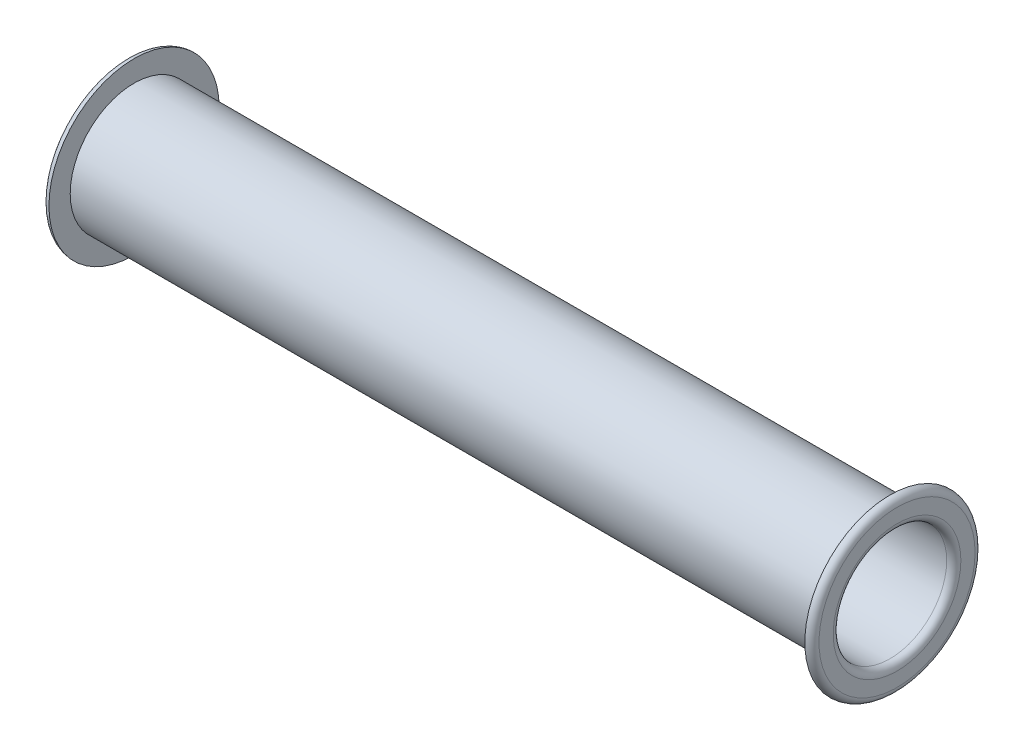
ISO-10303-21;
HEADER;
FILE_DESCRIPTION(('STEP AP214'),'2;1');
FILE_NAME('part.step','',(''),(''),'','','');
FILE_SCHEMA(('AUTOMOTIVE_DESIGN { 1 0 10303 214 1 1 1 1 }'));
ENDSEC;
DATA;
#1=APPLICATION_CONTEXT('core data for automotive mechanical design processes');
#2=APPLICATION_PROTOCOL_DEFINITION('international standard','automotive_design',2000,#1);
#3=PRODUCT_CONTEXT('',#1,'mechanical');
#4=PRODUCT('Part','Part','',(#3));
#5=PRODUCT_RELATED_PRODUCT_CATEGORY('part','',(#4));
#6=PRODUCT_DEFINITION_FORMATION('','',#4);
#7=PRODUCT_DEFINITION_CONTEXT('part definition',#1,'design');
#8=PRODUCT_DEFINITION('design','',#6,#7);
#9=PRODUCT_DEFINITION_SHAPE('','',#8);
#10=(LENGTH_UNIT() NAMED_UNIT(*) SI_UNIT(.MILLI.,.METRE.));
#11=(NAMED_UNIT(*) PLANE_ANGLE_UNIT() SI_UNIT($,.RADIAN.));
#12=(NAMED_UNIT(*) SI_UNIT($,.STERADIAN.) SOLID_ANGLE_UNIT());
#13=UNCERTAINTY_MEASURE_WITH_UNIT(LENGTH_MEASURE(1.E-05),#10,'distance_accuracy_value','');
#14=(GEOMETRIC_REPRESENTATION_CONTEXT(3) GLOBAL_UNCERTAINTY_ASSIGNED_CONTEXT((#13)) GLOBAL_UNIT_ASSIGNED_CONTEXT((#10,
#11,#12)) REPRESENTATION_CONTEXT('',''));
#15=CARTESIAN_POINT('',(0.,0.,0.));
#16=DIRECTION('',(0.,0.,1.));
#17=DIRECTION('',(1.,0.,0.));
#18=AXIS2_PLACEMENT_3D('',#15,#16,#17);
#19=CARTESIAN_POINT('',(13.53185,0.,0.));
#20=DIRECTION('',(-1.,0.,0.));
#21=DIRECTION('',(0.,0.,1.));
#22=AXIS2_PLACEMENT_3D('',#19,#20,#21);
#23=CYLINDRICAL_SURFACE('',#22,2.286);
#24=CARTESIAN_POINT('',(13.53185,0.,0.));
#25=DIRECTION('',(1.,0.,0.));
#26=DIRECTION('',(0.,0.,-1.));
#27=AXIS2_PLACEMENT_3D('',#24,#25,#26);
#28=CIRCLE('',#27,2.286);
#29=CARTESIAN_POINT('',(13.53185,0.,2.286));
#30=VERTEX_POINT('',#29);
#31=EDGE_CURVE('E56',#30,#30,#28,.T.);
#32=CARTESIAN_POINT('',(-13.53185,0.,0.));
#33=DIRECTION('',(-1.,0.,0.));
#34=DIRECTION('',(0.,0.,1.));
#35=AXIS2_PLACEMENT_3D('',#32,#33,#34);
#36=CIRCLE('',#35,2.286);
#37=CARTESIAN_POINT('',(-13.53185,0.,2.286));
#38=VERTEX_POINT('',#37);
#39=EDGE_CURVE('E62',#38,#38,#36,.T.);
#40=CARTESIAN_POINT('',(13.53185,0.,2.286));
#41=CARTESIAN_POINT('',(13.2499364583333,0.,2.286));
#42=CARTESIAN_POINT('',(12.9680229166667,0.,2.286));
#43=CARTESIAN_POINT('',(12.4041958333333,0.,2.286));
#44=CARTESIAN_POINT('',(12.1222822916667,0.,2.286));
#45=CARTESIAN_POINT('',(11.5584552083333,0.,2.286));
#46=CARTESIAN_POINT('',(11.2765416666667,0.,2.286));
#47=CARTESIAN_POINT('',(10.7127145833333,0.,2.286));
#48=CARTESIAN_POINT('',(10.4308010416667,0.,2.286));
#49=CARTESIAN_POINT('',(9.86697395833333,0.,2.286));
#50=CARTESIAN_POINT('',(9.58506041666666,0.,2.286));
#51=CARTESIAN_POINT('',(9.02123333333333,0.,2.286));
#52=CARTESIAN_POINT('',(8.73931979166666,0.,2.286));
#53=CARTESIAN_POINT('',(8.17549270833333,0.,2.286));
#54=CARTESIAN_POINT('',(7.89357916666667,0.,2.286));
#55=CARTESIAN_POINT('',(7.32975208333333,0.,2.286));
#56=CARTESIAN_POINT('',(7.04783854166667,0.,2.286));
#57=CARTESIAN_POINT('',(6.48401145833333,0.,2.286));
#58=CARTESIAN_POINT('',(6.20209791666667,0.,2.286));
#59=CARTESIAN_POINT('',(5.63827083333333,0.,2.286));
#60=CARTESIAN_POINT('',(5.35635729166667,0.,2.286));
#61=CARTESIAN_POINT('',(4.79253020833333,0.,2.286));
#62=CARTESIAN_POINT('',(4.51061666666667,0.,2.286));
#63=CARTESIAN_POINT('',(3.94678958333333,0.,2.286));
#64=CARTESIAN_POINT('',(3.66487604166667,0.,2.286));
#65=CARTESIAN_POINT('',(3.10104895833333,0.,2.286));
#66=CARTESIAN_POINT('',(2.81913541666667,0.,2.286));
#67=CARTESIAN_POINT('',(2.25530833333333,0.,2.286));
#68=CARTESIAN_POINT('',(1.97339479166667,0.,2.286));
#69=CARTESIAN_POINT('',(1.40956770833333,0.,2.286));
#70=CARTESIAN_POINT('',(1.12765416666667,0.,2.286));
#71=CARTESIAN_POINT('',(0.563827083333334,0.,2.286));
#72=CARTESIAN_POINT('',(0.281913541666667,0.,2.286));
#73=CARTESIAN_POINT('',(-0.281913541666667,0.,2.286));
#74=CARTESIAN_POINT('',(-0.563827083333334,0.,2.286));
#75=CARTESIAN_POINT('',(-1.12765416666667,0.,2.286));
#76=CARTESIAN_POINT('',(-1.40956770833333,0.,2.286));
#77=CARTESIAN_POINT('',(-1.97339479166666,0.,2.286));
#78=CARTESIAN_POINT('',(-2.25530833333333,0.,2.286));
#79=CARTESIAN_POINT('',(-2.81913541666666,0.,2.286));
#80=CARTESIAN_POINT('',(-3.10104895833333,0.,2.286));
#81=CARTESIAN_POINT('',(-3.66487604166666,0.,2.286));
#82=CARTESIAN_POINT('',(-3.94678958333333,0.,2.286));
#83=CARTESIAN_POINT('',(-4.51061666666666,0.,2.286));
#84=CARTESIAN_POINT('',(-4.79253020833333,0.,2.286));
#85=CARTESIAN_POINT('',(-5.35635729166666,0.,2.286));
#86=CARTESIAN_POINT('',(-5.63827083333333,0.,2.286));
#87=CARTESIAN_POINT('',(-6.20209791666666,0.,2.286));
#88=CARTESIAN_POINT('',(-6.48401145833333,0.,2.286));
#89=CARTESIAN_POINT('',(-7.04783854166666,0.,2.286));
#90=CARTESIAN_POINT('',(-7.32975208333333,0.,2.286));
#91=CARTESIAN_POINT('',(-7.89357916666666,0.,2.286));
#92=CARTESIAN_POINT('',(-8.17549270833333,0.,2.286));
#93=CARTESIAN_POINT('',(-8.73931979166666,0.,2.286));
#94=CARTESIAN_POINT('',(-9.02123333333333,0.,2.286));
#95=CARTESIAN_POINT('',(-9.58506041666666,0.,2.286));
#96=CARTESIAN_POINT('',(-9.86697395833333,0.,2.286));
#97=CARTESIAN_POINT('',(-10.4308010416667,0.,2.286));
#98=CARTESIAN_POINT('',(-10.7127145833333,0.,2.286));
#99=CARTESIAN_POINT('',(-11.2765416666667,0.,2.286));
#100=CARTESIAN_POINT('',(-11.5584552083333,0.,2.286));
#101=CARTESIAN_POINT('',(-12.1222822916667,0.,2.286));
#102=CARTESIAN_POINT('',(-12.4041958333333,0.,2.286));
#103=CARTESIAN_POINT('',(-12.9680229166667,0.,2.286));
#104=CARTESIAN_POINT('',(-13.2499364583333,0.,2.286));
#105=CARTESIAN_POINT('',(-13.53185,0.,2.286));
#106=B_SPLINE_CURVE_WITH_KNOTS('',3,(#40,#41,#42,#43,#44,#45,#46,#47,#48,#49,#50,#51,#52,#53,
#54,#55,#56,#57,#58,#59,#60,#61,#62,#63,#64,#65,#66,#67,#68,#69,#70,#71,#72,#73,#74,#75,#76,#77,
#78,#79,#80,#81,#82,#83,#84,#85,#86,#87,#88,#89,#90,#91,#92,#93,#94,#95,#96,#97,#98,#99,#100,
#101,#102,#103,#104,#105),.UNSPECIFIED.,.F.,.F.,(4,2,2,2,2,2,2,2,2,2,2,2,2,2,2,2,2,2,2,2,2,2,2,
2,2,2,2,2,2,2,2,2,4),(0.,0.845740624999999,1.69148125,2.537221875,3.3829625,4.228703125,
5.07444375,5.920184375,6.765925,7.611665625,8.45740625,9.303146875,10.1488875,10.994628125,
11.84036875,12.686109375,13.53185,14.377590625,15.22333125,16.069071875,16.9148125,17.760553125,
18.60629375,19.452034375,20.297775,21.143515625,21.98925625,22.834996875,23.6807375,
24.526478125,25.37221875,26.217959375,27.0637),.UNSPECIFIED.);
#107=EDGE_CURVE('BSEAM30',#30,#38,#106,.T.);
#108=ORIENTED_EDGE('',*,*,#31,.F.);
#109=ORIENTED_EDGE('',*,*,#39,.F.);
#110=ORIENTED_EDGE('',*,*,#107,.T.);
#111=ORIENTED_EDGE('',*,*,#107,.F.);
#112=EDGE_LOOP('',(#108,#110,#109,#111));
#113=FACE_BOUND('',#112,.T.);
#114=ADVANCED_FACE('F30',(#113),#23,.T.);
#115=CARTESIAN_POINT('',(13.53185,0.,0.));
#116=DIRECTION('',(1.,0.,0.));
#117=DIRECTION('',(0.,0.,-1.));
#118=AXIS2_PLACEMENT_3D('',#115,#116,#117);
#119=PLANE('',#118);
#120=CARTESIAN_POINT('',(13.53185,0.,0.));
#121=DIRECTION('',(1.,0.,0.));
#122=DIRECTION('',(0.,0.,-1.));
#123=AXIS2_PLACEMENT_3D('',#120,#121,#122);
#124=CIRCLE('',#123,3.048);
#125=CARTESIAN_POINT('',(13.53185,0.,-3.048));
#126=VERTEX_POINT('',#125);
#127=EDGE_CURVE('E59',#126,#126,#124,.T.);
#128=ORIENTED_EDGE('',*,*,#127,.F.);
#129=EDGE_LOOP('',(#128));
#130=FACE_BOUND('',#129,.T.);
#131=ORIENTED_EDGE('',*,*,#31,.T.);
#132=EDGE_LOOP('',(#131));
#133=FACE_BOUND('',#132,.T.);
#134=ADVANCED_FACE('F89',(#130,#133),#119,.F.);
#135=CARTESIAN_POINT('',(13.78585,0.,0.));
#136=DIRECTION('',(1.,0.,0.));
#137=DIRECTION('',(0.,0.,-1.));
#138=AXIS2_PLACEMENT_3D('',#135,#136,#137);
#139=PLANE('',#138);
#140=CARTESIAN_POINT('',(13.78585,0.,0.));
#141=DIRECTION('',(1.,0.,0.));
#142=DIRECTION('',(0.,0.,-1.));
#143=AXIS2_PLACEMENT_3D('',#140,#141,#142);
#144=CIRCLE('',#143,2.286);
#145=CARTESIAN_POINT('',(13.78585,0.,-2.286));
#146=VERTEX_POINT('',#145);
#147=EDGE_CURVE('E10',#146,#146,#144,.F.);
#148=ORIENTED_EDGE('',*,*,#147,.T.);
#149=EDGE_LOOP('',(#148));
#150=FACE_BOUND('',#149,.T.);
#151=CARTESIAN_POINT('',(13.78585,0.,0.));
#152=DIRECTION('',(1.,0.,0.));
#153=DIRECTION('',(0.,0.,-1.));
#154=AXIS2_PLACEMENT_3D('',#151,#152,#153);
#155=CIRCLE('',#154,2.794);
#156=CARTESIAN_POINT('',(13.78585,0.,-2.794));
#157=VERTEX_POINT('',#156);
#158=EDGE_CURVE('E53',#157,#157,#155,.T.);
#159=ORIENTED_EDGE('',*,*,#158,.T.);
#160=EDGE_LOOP('',(#159));
#161=FACE_BOUND('',#160,.T.);
#162=ADVANCED_FACE('F95',(#150,#161),#139,.T.);
#163=CARTESIAN_POINT('',(13.53185,0.,0.));
#164=DIRECTION('',(1.,0.,0.));
#165=DIRECTION('',(0.,0.,-1.));
#166=AXIS2_PLACEMENT_3D('',#163,#164,#165);
#167=TOROIDAL_SURFACE('',#166,2.794,0.254);
#168=ORIENTED_EDGE('',*,*,#127,.T.);
#169=EDGE_LOOP('',(#168));
#170=FACE_BOUND('',#169,.T.);
#171=ORIENTED_EDGE('',*,*,#158,.F.);
#172=EDGE_LOOP('',(#171));
#173=FACE_BOUND('',#172,.T.);
#174=ADVANCED_FACE('F101',(#170,#173),#167,.T.);
#175=CARTESIAN_POINT('',(-13.53185,0.,0.));
#176=DIRECTION('',(-1.,0.,0.));
#177=DIRECTION('',(0.,0.,-1.));
#178=AXIS2_PLACEMENT_3D('',#175,#176,#177);
#179=PLANE('',#178);
#180=CARTESIAN_POINT('',(-13.53185,0.,0.));
#181=DIRECTION('',(1.,0.,0.));
#182=DIRECTION('',(0.,0.,-1.));
#183=AXIS2_PLACEMENT_3D('',#180,#181,#182);
#184=CIRCLE('',#183,3.048);
#185=CARTESIAN_POINT('',(-13.53185,0.,-3.048));
#186=VERTEX_POINT('',#185);
#187=EDGE_CURVE('E65',#186,#186,#184,.T.);
#188=ORIENTED_EDGE('',*,*,#187,.T.);
#189=EDGE_LOOP('',(#188));
#190=FACE_BOUND('',#189,.T.);
#191=ORIENTED_EDGE('',*,*,#39,.T.);
#192=EDGE_LOOP('',(#191));
#193=FACE_BOUND('',#192,.T.);
#194=ADVANCED_FACE('F69',(#190,#193),#179,.F.);
#195=CARTESIAN_POINT('',(-13.78585,0.,0.));
#196=DIRECTION('',(-1.,0.,0.));
#197=DIRECTION('',(0.,0.,-1.));
#198=AXIS2_PLACEMENT_3D('',#195,#196,#197);
#199=PLANE('',#198);
#200=CARTESIAN_POINT('',(-13.78585,0.,0.));
#201=DIRECTION('',(-1.,0.,0.));
#202=DIRECTION('',(0.,0.,1.));
#203=AXIS2_PLACEMENT_3D('',#200,#201,#202);
#204=CIRCLE('',#203,2.286);
#205=CARTESIAN_POINT('',(-13.78585,0.,2.286));
#206=VERTEX_POINT('',#205);
#207=EDGE_CURVE('E45',#206,#206,#204,.F.);
#208=ORIENTED_EDGE('',*,*,#207,.T.);
#209=EDGE_LOOP('',(#208));
#210=FACE_BOUND('',#209,.T.);
#211=CARTESIAN_POINT('',(-13.78585,0.,0.));
#212=DIRECTION('',(-1.,0.,0.));
#213=DIRECTION('',(0.,0.,1.));
#214=AXIS2_PLACEMENT_3D('',#211,#212,#213);
#215=CIRCLE('',#214,2.794);
#216=CARTESIAN_POINT('',(-13.78585,0.,2.794));
#217=VERTEX_POINT('',#216);
#218=EDGE_CURVE('E50',#217,#217,#215,.T.);
#219=ORIENTED_EDGE('',*,*,#218,.T.);
#220=EDGE_LOOP('',(#219));
#221=FACE_BOUND('',#220,.T.);
#222=ADVANCED_FACE('F75',(#210,#221),#199,.T.);
#223=CARTESIAN_POINT('',(-13.53185,0.,0.));
#224=DIRECTION('',(-1.,0.,0.));
#225=DIRECTION('',(0.,0.,1.));
#226=AXIS2_PLACEMENT_3D('',#223,#224,#225);
#227=TOROIDAL_SURFACE('',#226,2.794,0.254);
#228=ORIENTED_EDGE('',*,*,#218,.F.);
#229=EDGE_LOOP('',(#228));
#230=FACE_BOUND('',#229,.T.);
#231=ORIENTED_EDGE('',*,*,#187,.F.);
#232=EDGE_LOOP('',(#231));
#233=FACE_BOUND('',#232,.T.);
#234=ADVANCED_FACE('F72',(#230,#233),#227,.T.);
#235=CARTESIAN_POINT('',(-13.78585,0.,0.));
#236=DIRECTION('',(1.,0.,0.));
#237=DIRECTION('',(0.,0.,-1.));
#238=AXIS2_PLACEMENT_3D('',#235,#236,#237);
#239=CYLINDRICAL_SURFACE('',#238,2.032);
#240=CARTESIAN_POINT('',(-13.53185,0.,0.));
#241=DIRECTION('',(-1.,0.,0.));
#242=DIRECTION('',(0.,0.,1.));
#243=AXIS2_PLACEMENT_3D('',#240,#241,#242);
#244=CIRCLE('',#243,2.032);
#245=CARTESIAN_POINT('',(-13.53185,0.,2.032));
#246=VERTEX_POINT('',#245);
#247=EDGE_CURVE('E37',#246,#246,#244,.T.);
#248=ORIENTED_EDGE('',*,*,#247,.T.);
#249=EDGE_LOOP('',(#248));
#250=FACE_BOUND('',#249,.T.);
#251=CARTESIAN_POINT('',(13.53185,0.,0.));
#252=DIRECTION('',(1.,0.,0.));
#253=DIRECTION('',(0.,0.,-1.));
#254=AXIS2_PLACEMENT_3D('',#251,#252,#253);
#255=CIRCLE('',#254,2.032);
#256=CARTESIAN_POINT('',(13.53185,0.,-2.032));
#257=VERTEX_POINT('',#256);
#258=EDGE_CURVE('E41',#257,#257,#255,.T.);
#259=ORIENTED_EDGE('',*,*,#258,.T.);
#260=EDGE_LOOP('',(#259));
#261=FACE_BOUND('',#260,.T.);
#262=ADVANCED_FACE('F74',(#250,#261),#239,.F.);
#263=CARTESIAN_POINT('',(-13.53185,0.,0.));
#264=DIRECTION('',(-1.,0.,0.));
#265=DIRECTION('',(0.,0.,1.));
#266=AXIS2_PLACEMENT_3D('',#263,#264,#265);
#267=TOROIDAL_SURFACE('',#266,2.286,0.254);
#268=ORIENTED_EDGE('',*,*,#247,.F.);
#269=EDGE_LOOP('',(#268));
#270=FACE_BOUND('',#269,.T.);
#271=ORIENTED_EDGE('',*,*,#207,.F.);
#272=EDGE_LOOP('',(#271));
#273=FACE_BOUND('',#272,.T.);
#274=ADVANCED_FACE('F82',(#270,#273),#267,.T.);
#275=CARTESIAN_POINT('',(13.53185,0.,0.));
#276=DIRECTION('',(1.,0.,0.));
#277=DIRECTION('',(0.,0.,-1.));
#278=AXIS2_PLACEMENT_3D('',#275,#276,#277);
#279=TOROIDAL_SURFACE('',#278,2.286,0.254);
#280=ORIENTED_EDGE('',*,*,#147,.F.);
#281=EDGE_LOOP('',(#280));
#282=FACE_BOUND('',#281,.T.);
#283=ORIENTED_EDGE('',*,*,#258,.F.);
#284=EDGE_LOOP('',(#283));
#285=FACE_BOUND('',#284,.T.);
#286=ADVANCED_FACE('F32',(#282,#285),#279,.T.);
#287=CLOSED_SHELL('',(#114,#134,#162,#174,#194,#222,#234,#262,#274,#286));
#288=MANIFOLD_SOLID_BREP('B2',#287);
#289=ADVANCED_BREP_SHAPE_REPRESENTATION('',(#18,#288),#14);
#290=SHAPE_DEFINITION_REPRESENTATION(#9,#289);
ENDSEC;
END-ISO-10303-21;
